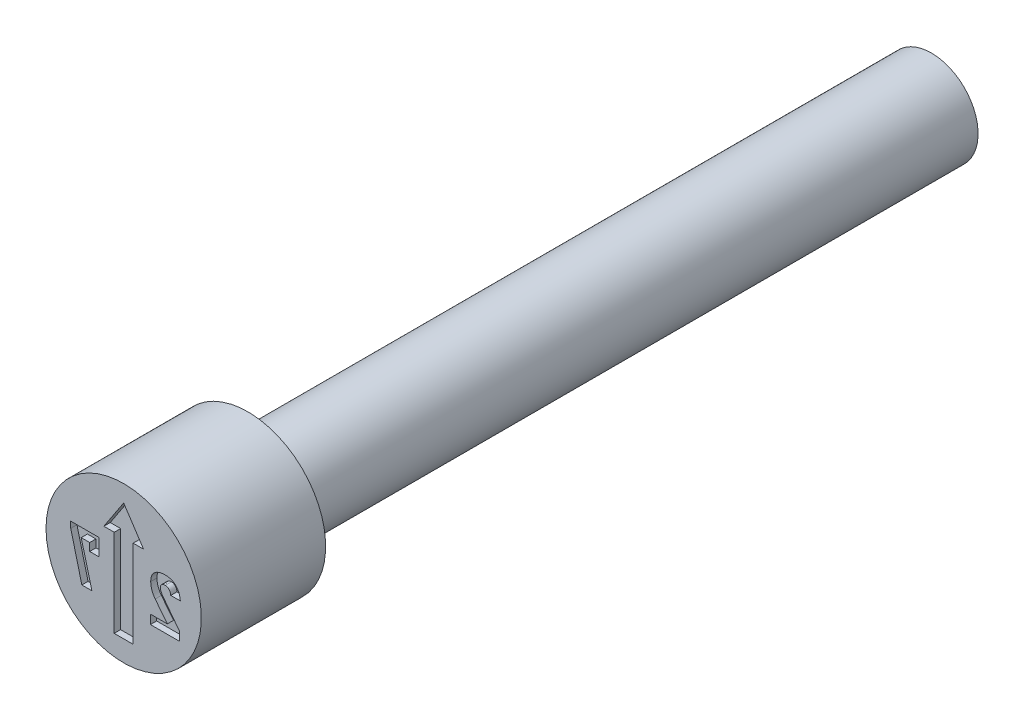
ISO-10303-21;
HEADER;
FILE_DESCRIPTION(('STEP AP214'),'2;1');
FILE_NAME('part.step','',(''),(''),'','','');
FILE_SCHEMA(('AUTOMOTIVE_DESIGN { 1 0 10303 214 1 1 1 1 }'));
ENDSEC;
DATA;
#1=APPLICATION_CONTEXT('core data for automotive mechanical design processes');
#2=APPLICATION_PROTOCOL_DEFINITION('international standard','automotive_design',2000,#1);
#3=PRODUCT_CONTEXT('',#1,'mechanical');
#4=PRODUCT('Part','Part','',(#3));
#5=PRODUCT_RELATED_PRODUCT_CATEGORY('part','',(#4));
#6=PRODUCT_DEFINITION_FORMATION('','',#4);
#7=PRODUCT_DEFINITION_CONTEXT('part definition',#1,'design');
#8=PRODUCT_DEFINITION('design','',#6,#7);
#9=PRODUCT_DEFINITION_SHAPE('','',#8);
#10=(LENGTH_UNIT() NAMED_UNIT(*) SI_UNIT(.MILLI.,.METRE.));
#11=(NAMED_UNIT(*) PLANE_ANGLE_UNIT() SI_UNIT($,.RADIAN.));
#12=(NAMED_UNIT(*) SI_UNIT($,.STERADIAN.) SOLID_ANGLE_UNIT());
#13=UNCERTAINTY_MEASURE_WITH_UNIT(LENGTH_MEASURE(1.E-05),#10,'distance_accuracy_value','');
#14=(GEOMETRIC_REPRESENTATION_CONTEXT(3) GLOBAL_UNCERTAINTY_ASSIGNED_CONTEXT((#13)) GLOBAL_UNIT_ASSIGNED_CONTEXT((#10,
#11,#12)) REPRESENTATION_CONTEXT('',''));
#15=CARTESIAN_POINT('',(0.,0.,0.));
#16=DIRECTION('',(0.,0.,1.));
#17=DIRECTION('',(1.,0.,0.));
#18=AXIS2_PLACEMENT_3D('',#15,#16,#17);
#19=CARTESIAN_POINT('',(-0.1524,0.495314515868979,-1.6556487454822));
#20=DIRECTION('',(-1.,0.,0.));
#21=DIRECTION('',(0.,-1.,0.));
#22=AXIS2_PLACEMENT_3D('',#19,#20,#21);
#23=PLANE('',#22);
#24=DIRECTION('',(0.,-1.,0.));
#25=VECTOR('',#24,1.);
#26=CARTESIAN_POINT('',(-0.1524,0.495314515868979,-0.10335957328));
#27=LINE('',#26,#25);
#28=CARTESIAN_POINT('',(-0.1524,0.495314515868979,-0.10335957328));
#29=VERTEX_POINT('',#28);
#30=CARTESIAN_POINT('',(-0.1524,-0.9144,-0.10335957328));
#31=VERTEX_POINT('',#30);
#32=EDGE_CURVE('E439',#29,#31,#27,.T.);
#33=ORIENTED_EDGE('',*,*,#32,.F.);
#34=DIRECTION('',(0.,0.,1.));
#35=VECTOR('',#34,1.);
#36=CARTESIAN_POINT('',(-0.1524,0.495314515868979,-0.10667978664));
#37=LINE('',#36,#35);
#38=CARTESIAN_POINT('',(-0.1524,0.495314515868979,0.));
#39=VERTEX_POINT('',#38);
#40=EDGE_CURVE('E425',#39,#29,#37,.F.);
#41=ORIENTED_EDGE('',*,*,#40,.F.);
#42=DIRECTION('',(0.,1.,0.));
#43=VECTOR('',#42,1.);
#44=CARTESIAN_POINT('',(-0.1524,0.,0.));
#45=LINE('',#44,#43);
#46=CARTESIAN_POINT('',(-0.1524,-0.9144,0.));
#47=VERTEX_POINT('',#46);
#48=EDGE_CURVE('E468',#47,#39,#45,.T.);
#49=ORIENTED_EDGE('',*,*,#48,.F.);
#50=DIRECTION('',(0.,0.,-1.));
#51=VECTOR('',#50,1.);
#52=CARTESIAN_POINT('',(-0.1524,-0.9144,-1.6556487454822));
#53=LINE('',#52,#51);
#54=EDGE_CURVE('E470',#47,#31,#53,.T.);
#55=ORIENTED_EDGE('',*,*,#54,.T.);
#56=EDGE_LOOP('',(#33,#41,#49,#55));
#57=FACE_BOUND('',#56,.T.);
#58=ADVANCED_FACE('F37',(#57),#23,.F.);
#59=CARTESIAN_POINT('',(2.096096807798E-13,0.495314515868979,-0.10667978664));
#60=DIRECTION('',(0.,1.,0.));
#61=DIRECTION('',(0.,0.,1.));
#62=AXIS2_PLACEMENT_3D('',#59,#60,#61);
#63=PLANE('',#62);
#64=ORIENTED_EDGE('',*,*,#40,.T.);
#65=DIRECTION('',(1.,0.,0.));
#66=VECTOR('',#65,1.);
#67=CARTESIAN_POINT('',(-0.31923088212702,0.495314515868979,-0.10335957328));
#68=LINE('',#67,#66);
#69=CARTESIAN_POINT('',(-0.319230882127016,0.495314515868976,-0.10335957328));
#70=VERTEX_POINT('',#69);
#71=EDGE_CURVE('E427',#70,#29,#68,.T.);
#72=ORIENTED_EDGE('',*,*,#71,.F.);
#73=DIRECTION('',(0.,0.,1.));
#74=VECTOR('',#73,1.);
#75=CARTESIAN_POINT('',(-0.319230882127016,0.495314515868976,-0.48767902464));
#76=LINE('',#75,#74);
#77=CARTESIAN_POINT('',(-0.31923088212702,0.495314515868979,0.));
#78=VERTEX_POINT('',#77);
#79=EDGE_CURVE('E432',#70,#78,#76,.T.);
#80=ORIENTED_EDGE('',*,*,#79,.T.);
#81=DIRECTION('',(1.,0.,0.));
#82=VECTOR('',#81,1.);
#83=CARTESIAN_POINT('',(0.62499875,0.495314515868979,0.));
#84=LINE('',#83,#82);
#85=EDGE_CURVE('E430',#39,#78,#84,.F.);
#86=ORIENTED_EDGE('',*,*,#85,.F.);
#87=EDGE_LOOP('',(#64,#72,#80,#86));
#88=FACE_BOUND('',#87,.T.);
#89=ADVANCED_FACE('F415',(#88),#63,.T.);
#90=CARTESIAN_POINT('',(-0.54143825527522,0.158036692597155,-0.48767902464));
#91=DIRECTION('',(-0.835059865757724,0.550159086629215,0.));
#92=DIRECTION('',(-0.550159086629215,-0.835059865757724,0.));
#93=AXIS2_PLACEMENT_3D('',#90,#91,#92);
#94=PLANE('',#93);
#95=DIRECTION('',(-0.550159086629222,-0.835059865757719,0.));
#96=VECTOR('',#95,1.);
#97=CARTESIAN_POINT('',(0.,0.979859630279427,-0.10335957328));
#98=LINE('',#97,#96);
#99=CARTESIAN_POINT('',(0.,0.979859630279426,-0.10335957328));
#100=VERTEX_POINT('',#99);
#101=EDGE_CURVE('E441',#100,#70,#98,.T.);
#102=ORIENTED_EDGE('',*,*,#101,.F.);
#103=DIRECTION('',(0.,0.,1.));
#104=VECTOR('',#103,1.);
#105=CARTESIAN_POINT('',(0.,0.979859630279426,-0.48767902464));
#106=LINE('',#105,#104);
#107=CARTESIAN_POINT('',(0.,0.979859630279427,0.));
#108=VERTEX_POINT('',#107);
#109=EDGE_CURVE('E480',#100,#108,#106,.T.);
#110=ORIENTED_EDGE('',*,*,#109,.T.);
#111=DIRECTION('',(0.550159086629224,0.835059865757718,0.));
#112=VECTOR('',#111,1.);
#113=CARTESIAN_POINT('',(-0.319230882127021,0.495314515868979,0.));
#114=LINE('',#113,#112);
#115=EDGE_CURVE('E464',#78,#108,#114,.T.);
#116=ORIENTED_EDGE('',*,*,#115,.F.);
#117=ORIENTED_EDGE('',*,*,#79,.F.);
#118=EDGE_LOOP('',(#102,#110,#116,#117));
#119=FACE_BOUND('',#118,.T.);
#120=ADVANCED_FACE('F412',(#119),#94,.F.);
#121=CARTESIAN_POINT('',(0.,0.979859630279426,-0.48767902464));
#122=DIRECTION('',(0.835059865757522,0.550159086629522,0.));
#123=DIRECTION('',(-0.550159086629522,0.835059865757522,0.));
#124=AXIS2_PLACEMENT_3D('',#121,#122,#123);
#125=PLANE('',#124);
#126=DIRECTION('',(-0.550159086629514,0.835059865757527,0.));
#127=VECTOR('',#126,1.);
#128=CARTESIAN_POINT('',(0.319230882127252,0.495314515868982,-0.10335957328));
#129=LINE('',#128,#127);
#130=CARTESIAN_POINT('',(0.319230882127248,0.495314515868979,-0.10335957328));
#131=VERTEX_POINT('',#130);
#132=EDGE_CURVE('E445',#131,#100,#129,.T.);
#133=ORIENTED_EDGE('',*,*,#132,.F.);
#134=DIRECTION('',(0.,0.,1.));
#135=VECTOR('',#134,1.);
#136=CARTESIAN_POINT('',(0.319230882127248,0.495314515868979,-0.10667978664));
#137=LINE('',#136,#135);
#138=CARTESIAN_POINT('',(0.319230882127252,0.495314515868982,0.));
#139=VERTEX_POINT('',#138);
#140=EDGE_CURVE('E477',#139,#131,#137,.F.);
#141=ORIENTED_EDGE('',*,*,#140,.F.);
#142=DIRECTION('',(0.550159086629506,-0.835059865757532,0.));
#143=VECTOR('',#142,1.);
#144=CARTESIAN_POINT('',(0.,0.979859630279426,0.));
#145=LINE('',#144,#143);
#146=EDGE_CURVE('E461',#108,#139,#145,.T.);
#147=ORIENTED_EDGE('',*,*,#146,.F.);
#148=ORIENTED_EDGE('',*,*,#109,.F.);
#149=EDGE_LOOP('',(#133,#141,#147,#148));
#150=FACE_BOUND('',#149,.T.);
#151=ADVANCED_FACE('F408',(#150),#125,.F.);
#152=CARTESIAN_POINT('',(2.096096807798E-13,0.495314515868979,-0.10667978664));
#153=DIRECTION('',(0.,1.,0.));
#154=DIRECTION('',(0.,0.,1.));
#155=AXIS2_PLACEMENT_3D('',#152,#153,#154);
#156=PLANE('',#155);
#157=ORIENTED_EDGE('',*,*,#140,.T.);
#158=DIRECTION('',(1.,0.,0.));
#159=VECTOR('',#158,1.);
#160=CARTESIAN_POINT('',(0.1524,0.495314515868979,-0.10335957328));
#161=LINE('',#160,#159);
#162=CARTESIAN_POINT('',(0.1524,0.495314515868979,-0.10335957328));
#163=VERTEX_POINT('',#162);
#164=EDGE_CURVE('E502',#163,#131,#161,.T.);
#165=ORIENTED_EDGE('',*,*,#164,.F.);
#166=DIRECTION('',(0.,0.,1.));
#167=VECTOR('',#166,1.);
#168=CARTESIAN_POINT('',(0.1524,0.495314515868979,-1.6556487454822));
#169=LINE('',#168,#167);
#170=CARTESIAN_POINT('',(0.1524,0.495314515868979,0.));
#171=VERTEX_POINT('',#170);
#172=EDGE_CURVE('E475',#163,#171,#169,.T.);
#173=ORIENTED_EDGE('',*,*,#172,.T.);
#174=DIRECTION('',(1.,0.,0.));
#175=VECTOR('',#174,1.);
#176=CARTESIAN_POINT('',(0.62499875,0.495314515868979,0.));
#177=LINE('',#176,#175);
#178=EDGE_CURVE('E458',#139,#171,#177,.F.);
#179=ORIENTED_EDGE('',*,*,#178,.F.);
#180=EDGE_LOOP('',(#157,#165,#173,#179));
#181=FACE_BOUND('',#180,.T.);
#182=ADVANCED_FACE('F404',(#181),#156,.T.);
#183=CARTESIAN_POINT('',(0.1524,0.495314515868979,-1.6556487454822));
#184=DIRECTION('',(1.,0.,0.));
#185=DIRECTION('',(0.,1.,0.));
#186=AXIS2_PLACEMENT_3D('',#183,#184,#185);
#187=PLANE('',#186);
#188=DIRECTION('',(0.,1.,0.));
#189=VECTOR('',#188,1.);
#190=CARTESIAN_POINT('',(0.1524,-0.9144,-0.10335957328));
#191=LINE('',#190,#189);
#192=CARTESIAN_POINT('',(0.1524,-0.9144,-0.10335957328));
#193=VERTEX_POINT('',#192);
#194=EDGE_CURVE('E433',#193,#163,#191,.T.);
#195=ORIENTED_EDGE('',*,*,#194,.F.);
#196=DIRECTION('',(0.,0.,-1.));
#197=VECTOR('',#196,1.);
#198=CARTESIAN_POINT('',(0.1524,-0.9144,-1.6556487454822));
#199=LINE('',#198,#197);
#200=CARTESIAN_POINT('',(0.1524,-0.9144,0.));
#201=VERTEX_POINT('',#200);
#202=EDGE_CURVE('E473',#193,#201,#199,.F.);
#203=ORIENTED_EDGE('',*,*,#202,.T.);
#204=DIRECTION('',(0.,1.,0.));
#205=VECTOR('',#204,1.);
#206=CARTESIAN_POINT('',(0.1524,0.,0.));
#207=LINE('',#206,#205);
#208=EDGE_CURVE('E455',#171,#201,#207,.F.);
#209=ORIENTED_EDGE('',*,*,#208,.F.);
#210=ORIENTED_EDGE('',*,*,#172,.F.);
#211=EDGE_LOOP('',(#195,#203,#209,#210));
#212=FACE_BOUND('',#211,.T.);
#213=ADVANCED_FACE('F400',(#212),#187,.F.);
#214=CARTESIAN_POINT('',(-0.1524,-0.9144,-1.6556487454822));
#215=DIRECTION('',(0.,-1.,0.));
#216=DIRECTION('',(0.,0.,-1.));
#217=AXIS2_PLACEMENT_3D('',#214,#215,#216);
#218=PLANE('',#217);
#219=DIRECTION('',(1.,0.,0.));
#220=VECTOR('',#219,1.);
#221=CARTESIAN_POINT('',(-0.1524,-0.9144,-0.10335957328));
#222=LINE('',#221,#220);
#223=EDGE_CURVE('E443',#31,#193,#222,.T.);
#224=ORIENTED_EDGE('',*,*,#223,.F.);
#225=ORIENTED_EDGE('',*,*,#54,.F.);
#226=DIRECTION('',(1.,0.,0.));
#227=VECTOR('',#226,1.);
#228=CARTESIAN_POINT('',(0.62499875,-0.9144,0.));
#229=LINE('',#228,#227);
#230=EDGE_CURVE('E452',#201,#47,#229,.F.);
#231=ORIENTED_EDGE('',*,*,#230,.F.);
#232=ORIENTED_EDGE('',*,*,#202,.F.);
#233=EDGE_LOOP('',(#224,#225,#231,#232));
#234=FACE_BOUND('',#233,.T.);
#235=ADVANCED_FACE('F383',(#234),#218,.F.);
#236=CARTESIAN_POINT('',(0.62499875,0.,0.));
#237=DIRECTION('',(0.,0.,1.));
#238=DIRECTION('',(1.,0.,0.));
#239=AXIS2_PLACEMENT_3D('',#236,#237,#238);
#240=PLANE('',#239);
#241=DIRECTION('',(-1.,0.,0.));
#242=VECTOR('',#241,1.);
#243=CARTESIAN_POINT('',(-0.396543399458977,0.3,0.));
#244=LINE('',#243,#242);
#245=CARTESIAN_POINT('',(-0.396543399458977,0.3,0.));
#246=VERTEX_POINT('',#245);
#247=CARTESIAN_POINT('',(-0.851738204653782,0.3,0.));
#248=VERTEX_POINT('',#247);
#249=EDGE_CURVE('E53',#246,#248,#244,.T.);
#250=ORIENTED_EDGE('',*,*,#249,.F.);
#251=DIRECTION('',(0.,1.,0.));
#252=VECTOR('',#251,1.);
#253=CARTESIAN_POINT('',(-0.396543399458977,0.0298701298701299,0.));
#254=LINE('',#253,#252);
#255=CARTESIAN_POINT('',(-0.396543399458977,0.0298701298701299,0.));
#256=VERTEX_POINT('',#255);
#257=EDGE_CURVE('E274',#256,#246,#254,.T.);
#258=ORIENTED_EDGE('',*,*,#257,.F.);
#259=DIRECTION('',(1.,0.,0.));
#260=VECTOR('',#259,1.);
#261=CARTESIAN_POINT('',(-0.546705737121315,0.0298701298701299,0.));
#262=LINE('',#261,#260);
#263=CARTESIAN_POINT('',(-0.546705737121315,0.0298701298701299,0.));
#264=VERTEX_POINT('',#263);
#265=EDGE_CURVE('E277',#264,#256,#262,.T.);
#266=ORIENTED_EDGE('',*,*,#265,.F.);
#267=DIRECTION('',(0.,-1.,0.));
#268=VECTOR('',#267,1.);
#269=CARTESIAN_POINT('',(-0.546705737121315,0.154545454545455,0.));
#270=LINE('',#269,#268);
#271=CARTESIAN_POINT('',(-0.546705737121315,0.154545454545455,0.));
#272=VERTEX_POINT('',#271);
#273=EDGE_CURVE('E311',#272,#264,#270,.T.);
#274=ORIENTED_EDGE('',*,*,#273,.F.);
#275=DIRECTION('',(1.,0.,0.));
#276=VECTOR('',#275,1.);
#277=CARTESIAN_POINT('',(-0.683556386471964,0.154545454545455,0.));
#278=LINE('',#277,#276);
#279=CARTESIAN_POINT('',(-0.683556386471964,0.154545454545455,0.));
#280=VERTEX_POINT('',#279);
#281=EDGE_CURVE('E308',#280,#272,#278,.T.);
#282=ORIENTED_EDGE('',*,*,#281,.F.);
#283=DIRECTION('',(-0.255602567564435,0.966781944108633,0.));
#284=VECTOR('',#283,1.);
#285=CARTESIAN_POINT('',(-0.510504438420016,-0.5,0.));
#286=LINE('',#285,#284);
#287=CARTESIAN_POINT('',(-0.510504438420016,-0.5,0.));
#288=VERTEX_POINT('',#287);
#289=EDGE_CURVE('E305',#288,#280,#286,.T.);
#290=ORIENTED_EDGE('',*,*,#289,.F.);
#291=DIRECTION('',(1.,0.,0.));
#292=VECTOR('',#291,1.);
#293=CARTESIAN_POINT('',(-0.673166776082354,-0.5,0.));
#294=LINE('',#293,#292);
#295=CARTESIAN_POINT('',(-0.673166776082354,-0.5,0.));
#296=VERTEX_POINT('',#295);
#297=EDGE_CURVE('E302',#296,#288,#294,.T.);
#298=ORIENTED_EDGE('',*,*,#297,.F.);
#299=DIRECTION('',(0.247293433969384,-0.968940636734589,0.));
#300=VECTOR('',#299,1.);
#301=CARTESIAN_POINT('',(-0.851738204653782,0.199675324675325,0.));
#302=LINE('',#301,#300);
#303=CARTESIAN_POINT('',(-0.851738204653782,0.199675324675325,0.));
#304=VERTEX_POINT('',#303);
#305=EDGE_CURVE('E299',#304,#296,#302,.T.);
#306=ORIENTED_EDGE('',*,*,#305,.F.);
#307=DIRECTION('',(0.,-1.,0.));
#308=VECTOR('',#307,1.);
#309=CARTESIAN_POINT('',(-0.851738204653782,0.3,0.));
#310=LINE('',#309,#308);
#311=EDGE_CURVE('E297',#248,#304,#310,.T.);
#312=ORIENTED_EDGE('',*,*,#311,.F.);
#313=EDGE_LOOP('',(#250,#258,#266,#274,#282,#290,#298,#306,#312));
#314=FACE_BOUND('',#313,.T.);
#315=DIRECTION('',(1.,0.,0.));
#316=VECTOR('',#315,1.);
#317=CARTESIAN_POINT('',(0.43070984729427,-0.5,0.));
#318=LINE('',#317,#316);
#319=CARTESIAN_POINT('',(0.43070984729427,-0.5,0.));
#320=VERTEX_POINT('',#319);
#321=CARTESIAN_POINT('',(0.901813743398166,-0.5,0.));
#322=VERTEX_POINT('',#321);
#323=EDGE_CURVE('E61',#320,#322,#318,.T.);
#324=ORIENTED_EDGE('',*,*,#323,.F.);
#325=DIRECTION('',(0.,-1.,0.));
#326=VECTOR('',#325,1.);
#327=CARTESIAN_POINT('',(0.43070984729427,-0.354545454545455,0.));
#328=LINE('',#327,#326);
#329=CARTESIAN_POINT('',(0.43070984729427,-0.354545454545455,0.));
#330=VERTEX_POINT('',#329);
#331=EDGE_CURVE('E335',#330,#320,#328,.T.);
#332=ORIENTED_EDGE('',*,*,#331,.F.);
#333=DIRECTION('',(-1.,0.,0.));
#334=VECTOR('',#333,1.);
#335=CARTESIAN_POINT('',(0.70295010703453,-0.354545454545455,0.));
#336=LINE('',#335,#334);
#337=CARTESIAN_POINT('',(0.70295010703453,-0.354545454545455,0.));
#338=VERTEX_POINT('',#337);
#339=EDGE_CURVE('E542',#338,#330,#336,.T.);
#340=ORIENTED_EDGE('',*,*,#339,.F.);
#341=DIRECTION('',(0.618183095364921,-0.786034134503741,0.));
#342=VECTOR('',#341,1.);
#343=CARTESIAN_POINT('',(0.506846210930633,-0.105194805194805,0.));
#344=LINE('',#343,#342);
#345=CARTESIAN_POINT('',(0.506846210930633,-0.105194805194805,0.));
#346=VERTEX_POINT('',#345);
#347=EDGE_CURVE('E545',#346,#338,#344,.T.);
#348=ORIENTED_EDGE('',*,*,#347,.F.);
#349=CARTESIAN_POINT('',(0.435092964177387,0.100649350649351,0.));
#350=CARTESIAN_POINT('',(0.43529993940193,0.0915468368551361,0.));
#351=CARTESIAN_POINT('',(0.435714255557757,0.0733257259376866,0.));
#352=CARTESIAN_POINT('',(0.439454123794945,0.0460552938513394,0.));
#353=CARTESIAN_POINT('',(0.445480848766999,0.0189240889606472,0.));
#354=CARTESIAN_POINT('',(0.453757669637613,-0.00793681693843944,0.));
#355=CARTESIAN_POINT('',(0.464039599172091,-0.0340621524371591,0.));
#356=CARTESIAN_POINT('',(0.476379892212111,-0.0590941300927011,0.));
#357=CARTESIAN_POINT('',(0.490307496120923,-0.0830438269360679,0.));
#358=CARTESIAN_POINT('',(0.501343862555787,-0.0978252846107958,0.));
#359=CARTESIAN_POINT('',(0.506846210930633,-0.105194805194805,0.));
#360=B_SPLINE_CURVE_WITH_KNOTS('',3,(#349,#350,#351,#352,#353,#354,#355,#356,#357,#358,#359),
.UNSPECIFIED.,.F.,.F.,(4,1,1,1,1,1,1,1,4),(0.,0.123046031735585,0.246309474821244,
0.371480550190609,0.498560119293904,0.626024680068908,0.750715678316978,0.875715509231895,1.),.UNSPECIFIED.);
#361=CARTESIAN_POINT('',(0.435092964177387,0.100649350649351,0.));
#362=VERTEX_POINT('',#361);
#363=EDGE_CURVE('E548',#362,#346,#360,.T.);
#364=ORIENTED_EDGE('',*,*,#363,.F.);
#365=DIRECTION('',(0.,-1.,0.));
#366=VECTOR('',#365,1.);
#367=CARTESIAN_POINT('',(0.435092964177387,0.101298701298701,0.));
#368=LINE('',#367,#366);
#369=CARTESIAN_POINT('',(0.435092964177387,0.101298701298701,0.));
#370=VERTEX_POINT('',#369);
#371=EDGE_CURVE('E553',#370,#362,#368,.T.);
#372=ORIENTED_EDGE('',*,*,#371,.F.);
#373=CARTESIAN_POINT('',(0.670644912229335,0.31038961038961,0.));
#374=CARTESIAN_POINT('',(0.661546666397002,0.310260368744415,0.));
#375=CARTESIAN_POINT('',(0.643851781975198,0.310009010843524,0.));
#376=CARTESIAN_POINT('',(0.618091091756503,0.307295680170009,0.));
#377=CARTESIAN_POINT('',(0.593853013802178,0.303200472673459,0.));
#378=CARTESIAN_POINT('',(0.571176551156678,0.297209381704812,0.));
#379=CARTESIAN_POINT('',(0.550152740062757,0.289394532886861,0.));
#380=CARTESIAN_POINT('',(0.530718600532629,0.27997174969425,0.));
#381=CARTESIAN_POINT('',(0.512833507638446,0.268860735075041,0.));
#382=CARTESIAN_POINT('',(0.496634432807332,0.256037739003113,0.));
#383=CARTESIAN_POINT('',(0.482059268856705,0.241735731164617,0.));
#384=CARTESIAN_POINT('',(0.469513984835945,0.225809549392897,0.));
#385=CARTESIAN_POINT('',(0.458653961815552,0.208581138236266,0.));
#386=CARTESIAN_POINT('',(0.450164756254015,0.189716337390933,0.));
#387=CARTESIAN_POINT('',(0.44317575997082,0.169658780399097,0.));
#388=CARTESIAN_POINT('',(0.438650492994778,0.148048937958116,0.));
#389=CARTESIAN_POINT('',(0.435601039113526,0.125141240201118,0.));
#390=CARTESIAN_POINT('',(0.43526500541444,0.109372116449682,0.));
#391=CARTESIAN_POINT('',(0.435092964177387,0.101298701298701,0.));
#392=B_SPLINE_CURVE_WITH_KNOTS('',3,(#373,#374,#375,#376,#377,#378,#379,#380,#381,#382,#383,
#384,#385,#386,#387,#388,#389,#390,#391),.UNSPECIFIED.,.F.,.F.,(4,1,1,1,1,1,1,1,1,1,1,1,1,1,1,1,
4),(0.,0.0762312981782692,0.148259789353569,0.216860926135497,0.282100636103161,
0.344528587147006,0.404571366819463,0.462840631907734,0.520642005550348,0.577409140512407,
0.633580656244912,0.690215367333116,0.747647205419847,0.806597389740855,0.867894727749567,
0.932365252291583,1.),.UNSPECIFIED.);
#393=CARTESIAN_POINT('',(0.670644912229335,0.31038961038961,0.));
#394=VERTEX_POINT('',#393);
#395=EDGE_CURVE('E559',#394,#370,#392,.T.);
#396=ORIENTED_EDGE('',*,*,#395,.F.);
#397=CARTESIAN_POINT('',(0.911716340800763,0.0702922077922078,0.));
#398=CARTESIAN_POINT('',(0.910956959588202,0.0795653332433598,0.));
#399=CARTESIAN_POINT('',(0.909474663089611,0.0976662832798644,0.));
#400=CARTESIAN_POINT('',(0.904615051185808,0.123850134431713,0.));
#401=CARTESIAN_POINT('',(0.898334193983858,0.14851353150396,0.));
#402=CARTESIAN_POINT('',(0.890344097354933,0.171651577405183,0.));
#403=CARTESIAN_POINT('',(0.880076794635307,0.192996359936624,0.));
#404=CARTESIAN_POINT('',(0.868541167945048,0.2129940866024,0.));
#405=CARTESIAN_POINT('',(0.854666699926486,0.231026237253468,0.));
#406=CARTESIAN_POINT('',(0.839479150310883,0.247696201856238,0.));
#407=CARTESIAN_POINT('',(0.822562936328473,0.26237886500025,0.));
#408=CARTESIAN_POINT('',(0.804525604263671,0.27533094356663,0.));
#409=CARTESIAN_POINT('',(0.78509440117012,0.286109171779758,0.));
#410=CARTESIAN_POINT('',(0.764564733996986,0.295050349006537,0.));
#411=CARTESIAN_POINT('',(0.742708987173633,0.301836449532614,0.));
#412=CARTESIAN_POINT('',(0.719812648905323,0.306919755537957,0.));
#413=CARTESIAN_POINT('',(0.695612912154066,0.309851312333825,0.));
#414=CARTESIAN_POINT('',(0.679094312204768,0.310207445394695,0.));
#415=CARTESIAN_POINT('',(0.670644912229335,0.31038961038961,0.));
#416=B_SPLINE_CURVE_WITH_KNOTS('',3,(#397,#398,#399,#400,#401,#402,#403,#404,#405,#406,#407,
#408,#409,#410,#411,#412,#413,#414,#415),.UNSPECIFIED.,.F.,.F.,(4,1,1,1,1,1,1,1,1,1,1,1,1,1,1,1,
4),(0.,0.073326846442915,0.14313249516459,0.209679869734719,0.273918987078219,0.335762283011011,
0.396210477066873,0.45560885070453,0.514796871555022,0.573764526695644,0.631900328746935,
0.689592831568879,0.748648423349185,0.808163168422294,0.86976604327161,0.933384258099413,1.),.UNSPECIFIED.);
#417=CARTESIAN_POINT('',(0.911716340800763,0.0702922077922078,0.));
#418=VERTEX_POINT('',#417);
#419=EDGE_CURVE('E564',#418,#394,#416,.T.);
#420=ORIENTED_EDGE('',*,*,#419,.F.);
#421=DIRECTION('',(0.,1.,0.));
#422=VECTOR('',#421,1.);
#423=CARTESIAN_POINT('',(0.911716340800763,0.0698051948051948,0.));
#424=LINE('',#423,#422);
#425=CARTESIAN_POINT('',(0.911716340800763,0.0698051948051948,0.));
#426=VERTEX_POINT('',#425);
#427=EDGE_CURVE('E572',#426,#418,#424,.T.);
#428=ORIENTED_EDGE('',*,*,#427,.F.);
#429=DIRECTION('',(1.,0.,0.));
#430=VECTOR('',#429,1.);
#431=CARTESIAN_POINT('',(0.757820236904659,0.0698051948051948,0.));
#432=LINE('',#431,#430);
#433=CARTESIAN_POINT('',(0.757820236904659,0.0698051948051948,0.));
#434=VERTEX_POINT('',#433);
#435=EDGE_CURVE('E578',#434,#426,#432,.T.);
#436=ORIENTED_EDGE('',*,*,#435,.F.);
#437=DIRECTION('',(0.,-1.,0.));
#438=VECTOR('',#437,1.);
#439=CARTESIAN_POINT('',(0.757820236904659,0.0702922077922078,0.));
#440=LINE('',#439,#438);
#441=CARTESIAN_POINT('',(0.75782023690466,0.0702922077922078,0.));
#442=VERTEX_POINT('',#441);
#443=EDGE_CURVE('E581',#442,#434,#440,.T.);
#444=ORIENTED_EDGE('',*,*,#443,.F.);
#445=CARTESIAN_POINT('',(0.669508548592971,0.164935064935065,0.));
#446=CARTESIAN_POINT('',(0.675389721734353,0.164705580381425,0.));
#447=CARTESIAN_POINT('',(0.686817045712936,0.164259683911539,0.));
#448=CARTESIAN_POINT('',(0.702994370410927,0.159317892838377,0.));
#449=CARTESIAN_POINT('',(0.717571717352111,0.151566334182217,0.));
#450=CARTESIAN_POINT('',(0.730138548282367,0.140505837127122,0.));
#451=CARTESIAN_POINT('',(0.740544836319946,0.126618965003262,0.));
#452=CARTESIAN_POINT('',(0.748990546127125,0.110266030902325,0.));
#453=CARTESIAN_POINT('',(0.75472680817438,0.0911517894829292,0.));
#454=CARTESIAN_POINT('',(0.756755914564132,0.0774691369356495,0.));
#455=CARTESIAN_POINT('',(0.75782023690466,0.0702922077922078,0.));
#456=B_SPLINE_CURVE_WITH_KNOTS('',3,(#445,#446,#447,#448,#449,#450,#451,#452,#453,#454,#455),
.UNSPECIFIED.,.F.,.F.,(4,1,1,1,1,1,1,1,4),(0.,0.122603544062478,0.238222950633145,
0.350089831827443,0.465559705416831,0.58502806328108,0.711014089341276,0.848418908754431,1.),.UNSPECIFIED.);
#457=CARTESIAN_POINT('',(0.669508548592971,0.164935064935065,0.));
#458=VERTEX_POINT('',#457);
#459=EDGE_CURVE('E584',#458,#442,#456,.T.);
#460=ORIENTED_EDGE('',*,*,#459,.F.);
#461=CARTESIAN_POINT('',(0.589638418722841,0.0970779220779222,0.));
#462=CARTESIAN_POINT('',(0.589860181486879,0.102193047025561,0.));
#463=CARTESIAN_POINT('',(0.590285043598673,0.11199281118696,0.));
#464=CARTESIAN_POINT('',(0.59428791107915,0.125800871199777,0.));
#465=CARTESIAN_POINT('',(0.600848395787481,0.137825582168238,0.));
#466=CARTESIAN_POINT('',(0.610244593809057,0.147757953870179,0.));
#467=CARTESIAN_POINT('',(0.621942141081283,0.155613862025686,0.));
#468=CARTESIAN_POINT('',(0.635938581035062,0.161150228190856,0.));
#469=CARTESIAN_POINT('',(0.652050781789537,0.164324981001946,0.));
#470=CARTESIAN_POINT('',(0.663487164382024,0.164724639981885,0.));
#471=CARTESIAN_POINT('',(0.669508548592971,0.164935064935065,0.));
#472=B_SPLINE_CURVE_WITH_KNOTS('',3,(#461,#462,#463,#464,#465,#466,#467,#468,#469,#470,#471),
.UNSPECIFIED.,.F.,.F.,(4,1,1,1,1,1,1,1,4),(0.,0.128749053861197,0.246662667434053,
0.359069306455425,0.47107757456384,0.588039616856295,0.711712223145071,0.848213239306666,1.),.UNSPECIFIED.);
#473=CARTESIAN_POINT('',(0.589638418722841,0.0970779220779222,0.));
#474=VERTEX_POINT('',#473);
#475=EDGE_CURVE('E589',#474,#458,#472,.T.);
#476=ORIENTED_EDGE('',*,*,#475,.F.);
#477=DIRECTION('',(0.,1.,0.));
#478=VECTOR('',#477,1.);
#479=CARTESIAN_POINT('',(0.589638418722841,0.0959415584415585,0.));
#480=LINE('',#479,#478);
#481=CARTESIAN_POINT('',(0.589638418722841,0.0959415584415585,0.));
#482=VERTEX_POINT('',#481);
#483=EDGE_CURVE('E597',#482,#474,#480,.T.);
#484=ORIENTED_EDGE('',*,*,#483,.F.);
#485=CARTESIAN_POINT('',(0.628437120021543,-0.00178571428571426,0.));
#486=CARTESIAN_POINT('',(0.622711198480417,0.00628241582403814,0.));
#487=CARTESIAN_POINT('',(0.611554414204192,0.0220029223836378,0.));
#488=CARTESIAN_POINT('',(0.601456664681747,0.0435918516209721,0.));
#489=CARTESIAN_POINT('',(0.595166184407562,0.060517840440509,0.));
#490=CARTESIAN_POINT('',(0.592168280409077,0.0727925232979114,0.));
#491=CARTESIAN_POINT('',(0.590029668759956,0.0845037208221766,0.));
#492=CARTESIAN_POINT('',(0.58976644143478,0.0921989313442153,0.));
#493=CARTESIAN_POINT('',(0.589638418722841,0.0959415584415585,0.));
#494=B_SPLINE_CURVE_WITH_KNOTS('',3,(#485,#486,#487,#488,#489,#490,#491,#492,#493),
.UNSPECIFIED.,.F.,.F.,(4,1,1,1,1,1,4),(0.,0.277375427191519,0.540457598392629,0.666416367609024,
0.784009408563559,0.894951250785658,1.),.UNSPECIFIED.);
#495=CARTESIAN_POINT('',(0.628437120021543,-0.00178571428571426,0.));
#496=VERTEX_POINT('',#495);
#497=EDGE_CURVE('E603',#496,#482,#494,.T.);
#498=ORIENTED_EDGE('',*,*,#497,.F.);
#499=DIRECTION('',(-0.602458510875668,0.798150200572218,0.));
#500=VECTOR('',#499,1.);
#501=CARTESIAN_POINT('',(0.901813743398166,-0.363961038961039,0.));
#502=LINE('',#501,#500);
#503=CARTESIAN_POINT('',(0.901813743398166,-0.363961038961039,0.));
#504=VERTEX_POINT('',#503);
#505=EDGE_CURVE('E608',#504,#496,#502,.T.);
#506=ORIENTED_EDGE('',*,*,#505,.F.);
#507=DIRECTION('',(0.,1.,0.));
#508=VECTOR('',#507,1.);
#509=CARTESIAN_POINT('',(0.901813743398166,-0.5,0.));
#510=LINE('',#509,#508);
#511=EDGE_CURVE('E614',#322,#504,#510,.T.);
#512=ORIENTED_EDGE('',*,*,#511,.F.);
#513=EDGE_LOOP('',(#324,#332,#340,#348,#364,#372,#396,#420,#428,#436,#444,#460,#476,#484,#498,
#506,#512));
#514=FACE_BOUND('',#513,.T.);
#515=CARTESIAN_POINT('',(0.,0.,0.));
#516=DIRECTION('',(0.,0.,-1.));
#517=DIRECTION('',(-1.,0.,0.));
#518=AXIS2_PLACEMENT_3D('',#515,#516,#517);
#519=CIRCLE('',#518,1.2499975);
#520=CARTESIAN_POINT('',(-1.2499975,0.,0.));
#521=VERTEX_POINT('',#520);
#522=EDGE_CURVE('E40',#521,#521,#519,.T.);
#523=ORIENTED_EDGE('',*,*,#522,.F.);
#524=EDGE_LOOP('',(#523));
#525=FACE_BOUND('',#524,.T.);
#526=ORIENTED_EDGE('',*,*,#208,.T.);
#527=ORIENTED_EDGE('',*,*,#230,.T.);
#528=ORIENTED_EDGE('',*,*,#48,.T.);
#529=ORIENTED_EDGE('',*,*,#85,.T.);
#530=ORIENTED_EDGE('',*,*,#115,.T.);
#531=ORIENTED_EDGE('',*,*,#146,.T.);
#532=ORIENTED_EDGE('',*,*,#178,.T.);
#533=EDGE_LOOP('',(#526,#527,#528,#529,#530,#531,#532));
#534=FACE_BOUND('',#533,.T.);
#535=ADVANCED_FACE('F378',(#314,#514,#525,#534),#240,.T.);
#536=CARTESIAN_POINT('',(0.,0.,-0.999998));
#537=DIRECTION('',(0.,0.,-1.));
#538=DIRECTION('',(-1.,0.,0.));
#539=AXIS2_PLACEMENT_3D('',#536,#537,#538);
#540=CYLINDRICAL_SURFACE('',#539,1.2499975);
#541=ORIENTED_EDGE('',*,*,#522,.T.);
#542=EDGE_LOOP('',(#541));
#543=FACE_BOUND('',#542,.T.);
#544=CARTESIAN_POINT('',(0.,0.,-1.999996));
#545=DIRECTION('',(0.,0.,-1.));
#546=DIRECTION('',(-1.,0.,0.));
#547=AXIS2_PLACEMENT_3D('',#544,#545,#546);
#548=CIRCLE('',#547,1.2499975);
#549=CARTESIAN_POINT('',(-1.2499975,0.,-1.999996));
#550=VERTEX_POINT('',#549);
#551=EDGE_CURVE('E484',#550,#550,#548,.T.);
#552=ORIENTED_EDGE('',*,*,#551,.F.);
#553=EDGE_LOOP('',(#552));
#554=FACE_BOUND('',#553,.T.);
#555=ADVANCED_FACE('F390',(#543,#554),#540,.T.);
#556=CARTESIAN_POINT('',(0.999998,0.,-1.999996));
#557=DIRECTION('',(0.,0.,-1.));
#558=DIRECTION('',(-1.,0.,0.));
#559=AXIS2_PLACEMENT_3D('',#556,#557,#558);
#560=PLANE('',#559);
#561=CARTESIAN_POINT('',(0.,0.,-1.999996));
#562=DIRECTION('',(0.,0.,-1.));
#563=DIRECTION('',(-1.,0.,0.));
#564=AXIS2_PLACEMENT_3D('',#561,#562,#563);
#565=CIRCLE('',#564,0.7499985);
#566=CARTESIAN_POINT('',(-0.749998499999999,0.,-1.999996));
#567=VERTEX_POINT('',#566);
#568=EDGE_CURVE('E45',#567,#567,#565,.T.);
#569=ORIENTED_EDGE('',*,*,#568,.F.);
#570=EDGE_LOOP('',(#569));
#571=FACE_BOUND('',#570,.T.);
#572=ORIENTED_EDGE('',*,*,#551,.T.);
#573=EDGE_LOOP('',(#572));
#574=FACE_BOUND('',#573,.T.);
#575=ADVANCED_FACE('F386',(#571,#574),#560,.T.);
#576=CARTESIAN_POINT('',(0.37499925,0.,-12.999974));
#577=DIRECTION('',(0.,0.,-1.));
#578=DIRECTION('',(-1.,0.,0.));
#579=AXIS2_PLACEMENT_3D('',#576,#577,#578);
#580=PLANE('',#579);
#581=CARTESIAN_POINT('',(0.,0.,-12.999974));
#582=DIRECTION('',(0.,0.,-1.));
#583=DIRECTION('',(-1.,0.,0.));
#584=AXIS2_PLACEMENT_3D('',#581,#582,#583);
#585=CIRCLE('',#584,0.7499985);
#586=CARTESIAN_POINT('',(-0.749998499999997,0.,-12.999974));
#587=VERTEX_POINT('',#586);
#588=EDGE_CURVE('E11',#587,#587,#585,.F.);
#589=ORIENTED_EDGE('',*,*,#588,.F.);
#590=EDGE_LOOP('',(#589));
#591=FACE_BOUND('',#590,.T.);
#592=ADVANCED_FACE('F381',(#591),#580,.T.);
#593=CARTESIAN_POINT('',(0.,0.,-7.499985));
#594=DIRECTION('',(0.,0.,-1.));
#595=DIRECTION('',(-1.,0.,0.));
#596=AXIS2_PLACEMENT_3D('',#593,#594,#595);
#597=CYLINDRICAL_SURFACE('',#596,0.7499985);
#598=ORIENTED_EDGE('',*,*,#568,.T.);
#599=EDGE_LOOP('',(#598));
#600=FACE_BOUND('',#599,.T.);
#601=ORIENTED_EDGE('',*,*,#588,.T.);
#602=EDGE_LOOP('',(#601));
#603=FACE_BOUND('',#602,.T.);
#604=ADVANCED_FACE('F376',(#600,#603),#597,.T.);
#605=CARTESIAN_POINT('',(0.,0.,-0.10335957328));
#606=DIRECTION('',(0.,0.,-1.));
#607=DIRECTION('',(-1.,0.,0.));
#608=AXIS2_PLACEMENT_3D('',#605,#606,#607);
#609=PLANE('',#608);
#610=ORIENTED_EDGE('',*,*,#164,.T.);
#611=ORIENTED_EDGE('',*,*,#132,.T.);
#612=ORIENTED_EDGE('',*,*,#101,.T.);
#613=ORIENTED_EDGE('',*,*,#71,.T.);
#614=ORIENTED_EDGE('',*,*,#32,.T.);
#615=ORIENTED_EDGE('',*,*,#223,.T.);
#616=ORIENTED_EDGE('',*,*,#194,.T.);
#617=EDGE_LOOP('',(#610,#611,#612,#613,#614,#615,#616));
#618=FACE_BOUND('',#617,.T.);
#619=ADVANCED_FACE('F373',(#618),#609,.F.);
#620=CARTESIAN_POINT('',(0.43070984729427,-0.5,-0.1));
#621=DIRECTION('',(0.,-1.,0.));
#622=DIRECTION('',(0.,0.,-1.));
#623=AXIS2_PLACEMENT_3D('',#620,#621,#622);
#624=PLANE('',#623);
#625=ORIENTED_EDGE('',*,*,#323,.T.);
#626=DIRECTION('',(0.,0.,1.));
#627=VECTOR('',#626,1.);
#628=CARTESIAN_POINT('',(0.901813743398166,-0.5,-0.1));
#629=LINE('',#628,#627);
#630=CARTESIAN_POINT('',(0.901813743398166,-0.5,-0.1));
#631=VERTEX_POINT('',#630);
#632=EDGE_CURVE('E508',#631,#322,#629,.T.);
#633=ORIENTED_EDGE('',*,*,#632,.F.);
#634=DIRECTION('',(1.,0.,0.));
#635=VECTOR('',#634,1.);
#636=CARTESIAN_POINT('',(0.43070984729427,-0.5,-0.1));
#637=LINE('',#636,#635);
#638=CARTESIAN_POINT('',(0.43070984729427,-0.5,-0.1));
#639=VERTEX_POINT('',#638);
#640=EDGE_CURVE('E331',#639,#631,#637,.T.);
#641=ORIENTED_EDGE('',*,*,#640,.F.);
#642=DIRECTION('',(0.,0.,1.));
#643=VECTOR('',#642,1.);
#644=CARTESIAN_POINT('',(0.43070984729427,-0.5,-0.1));
#645=LINE('',#644,#643);
#646=EDGE_CURVE('E503',#639,#320,#645,.T.);
#647=ORIENTED_EDGE('',*,*,#646,.T.);
#648=EDGE_LOOP('',(#625,#633,#641,#647));
#649=FACE_BOUND('',#648,.T.);
#650=ADVANCED_FACE('F369',(#649),#624,.F.);
#651=CARTESIAN_POINT('',(0.43070984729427,-0.354545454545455,-0.1));
#652=DIRECTION('',(-1.,0.,0.));
#653=DIRECTION('',(0.,0.,1.));
#654=AXIS2_PLACEMENT_3D('',#651,#652,#653);
#655=PLANE('',#654);
#656=ORIENTED_EDGE('',*,*,#331,.T.);
#657=ORIENTED_EDGE('',*,*,#646,.F.);
#658=DIRECTION('',(0.,-1.,0.));
#659=VECTOR('',#658,1.);
#660=CARTESIAN_POINT('',(0.43070984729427,-0.354545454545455,-0.1));
#661=LINE('',#660,#659);
#662=CARTESIAN_POINT('',(0.43070984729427,-0.354545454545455,-0.1));
#663=VERTEX_POINT('',#662);
#664=EDGE_CURVE('E511',#663,#639,#661,.T.);
#665=ORIENTED_EDGE('',*,*,#664,.F.);
#666=DIRECTION('',(0.,0.,1.));
#667=VECTOR('',#666,1.);
#668=CARTESIAN_POINT('',(0.43070984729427,-0.354545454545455,-0.1));
#669=LINE('',#668,#667);
#670=EDGE_CURVE('E505',#663,#330,#669,.T.);
#671=ORIENTED_EDGE('',*,*,#670,.T.);
#672=EDGE_LOOP('',(#656,#657,#665,#671));
#673=FACE_BOUND('',#672,.T.);
#674=ADVANCED_FACE('F372',(#673),#655,.F.);
#675=CARTESIAN_POINT('',(0.70295010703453,-0.354545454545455,-0.1));
#676=DIRECTION('',(0.,1.,0.));
#677=DIRECTION('',(0.,0.,1.));
#678=AXIS2_PLACEMENT_3D('',#675,#676,#677);
#679=PLANE('',#678);
#680=ORIENTED_EDGE('',*,*,#339,.T.);
#681=ORIENTED_EDGE('',*,*,#670,.F.);
#682=DIRECTION('',(-1.,0.,0.));
#683=VECTOR('',#682,1.);
#684=CARTESIAN_POINT('',(0.70295010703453,-0.354545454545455,-0.1));
#685=LINE('',#684,#683);
#686=CARTESIAN_POINT('',(0.70295010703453,-0.354545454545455,-0.1));
#687=VERTEX_POINT('',#686);
#688=EDGE_CURVE('E620',#687,#663,#685,.T.);
#689=ORIENTED_EDGE('',*,*,#688,.F.);
#690=DIRECTION('',(0.,0.,1.));
#691=VECTOR('',#690,1.);
#692=CARTESIAN_POINT('',(0.70295010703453,-0.354545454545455,-0.1));
#693=LINE('',#692,#691);
#694=EDGE_CURVE('E537',#687,#338,#693,.T.);
#695=ORIENTED_EDGE('',*,*,#694,.T.);
#696=EDGE_LOOP('',(#680,#681,#689,#695));
#697=FACE_BOUND('',#696,.T.);
#698=ADVANCED_FACE('F735',(#697),#679,.F.);
#699=CARTESIAN_POINT('',(0.506846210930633,-0.105194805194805,-0.1));
#700=DIRECTION('',(-0.786034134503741,-0.618183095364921,0.));
#701=DIRECTION('',(0.618183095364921,-0.786034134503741,0.));
#702=AXIS2_PLACEMENT_3D('',#699,#700,#701);
#703=PLANE('',#702);
#704=ORIENTED_EDGE('',*,*,#347,.T.);
#705=ORIENTED_EDGE('',*,*,#694,.F.);
#706=DIRECTION('',(0.618183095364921,-0.786034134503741,0.));
#707=VECTOR('',#706,1.);
#708=CARTESIAN_POINT('',(0.506846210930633,-0.105194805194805,-0.1));
#709=LINE('',#708,#707);
#710=CARTESIAN_POINT('',(0.506846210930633,-0.105194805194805,-0.1));
#711=VERTEX_POINT('',#710);
#712=EDGE_CURVE('E623',#711,#687,#709,.T.);
#713=ORIENTED_EDGE('',*,*,#712,.F.);
#714=DIRECTION('',(0.,0.,1.));
#715=VECTOR('',#714,1.);
#716=CARTESIAN_POINT('',(0.506846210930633,-0.105194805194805,-0.1));
#717=LINE('',#716,#715);
#718=EDGE_CURVE('E535',#711,#346,#717,.T.);
#719=ORIENTED_EDGE('',*,*,#718,.T.);
#720=EDGE_LOOP('',(#704,#705,#713,#719));
#721=FACE_BOUND('',#720,.T.);
#722=ADVANCED_FACE('F643',(#721),#703,.F.);
#723=CARTESIAN_POINT('',(0.435092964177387,0.100649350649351,-0.1));
#724=CARTESIAN_POINT('',(0.43529993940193,0.0915468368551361,-0.1));
#725=CARTESIAN_POINT('',(0.435714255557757,0.0733257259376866,-0.1));
#726=CARTESIAN_POINT('',(0.439454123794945,0.0460552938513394,-0.1));
#727=CARTESIAN_POINT('',(0.445480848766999,0.0189240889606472,-0.1));
#728=CARTESIAN_POINT('',(0.453757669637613,-0.00793681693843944,-0.1));
#729=CARTESIAN_POINT('',(0.464039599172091,-0.0340621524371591,-0.1));
#730=CARTESIAN_POINT('',(0.476379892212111,-0.0590941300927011,-0.1));
#731=CARTESIAN_POINT('',(0.490307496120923,-0.0830438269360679,-0.1));
#732=CARTESIAN_POINT('',(0.501343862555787,-0.0978252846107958,-0.1));
#733=CARTESIAN_POINT('',(0.506846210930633,-0.105194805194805,-0.1));
#734=B_SPLINE_CURVE_WITH_KNOTS('',3,(#723,#724,#725,#726,#727,#728,#729,#730,#731,#732,#733),
.UNSPECIFIED.,.F.,.F.,(4,1,1,1,1,1,1,1,4),(0.,0.123046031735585,0.246309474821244,
0.371480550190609,0.498560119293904,0.626024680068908,0.750715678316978,0.875715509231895,1.),.UNSPECIFIED.);
#735=DIRECTION('',(0.,0.,1.));
#736=VECTOR('',#735,1.);
#737=SURFACE_OF_LINEAR_EXTRUSION('',#734,#736);
#738=ORIENTED_EDGE('',*,*,#363,.T.);
#739=ORIENTED_EDGE('',*,*,#718,.F.);
#740=CARTESIAN_POINT('',(0.435092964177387,0.100649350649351,-0.1));
#741=VERTEX_POINT('',#740);
#742=EDGE_CURVE('E626',#741,#711,#734,.T.);
#743=ORIENTED_EDGE('',*,*,#742,.F.);
#744=DIRECTION('',(0.,0.,1.));
#745=VECTOR('',#744,1.);
#746=CARTESIAN_POINT('',(0.435092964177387,0.100649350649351,-0.1));
#747=LINE('',#746,#745);
#748=EDGE_CURVE('E533',#741,#362,#747,.T.);
#749=ORIENTED_EDGE('',*,*,#748,.T.);
#750=EDGE_LOOP('',(#738,#739,#743,#749));
#751=FACE_BOUND('',#750,.T.);
#752=ADVANCED_FACE('F638',(#751),#737,.F.);
#753=CARTESIAN_POINT('',(0.435092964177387,0.101298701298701,-0.1));
#754=DIRECTION('',(-1.,0.,0.));
#755=DIRECTION('',(0.,0.,1.));
#756=AXIS2_PLACEMENT_3D('',#753,#754,#755);
#757=PLANE('',#756);
#758=ORIENTED_EDGE('',*,*,#371,.T.);
#759=ORIENTED_EDGE('',*,*,#748,.F.);
#760=DIRECTION('',(0.,-1.,0.));
#761=VECTOR('',#760,1.);
#762=CARTESIAN_POINT('',(0.435092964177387,0.101298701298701,-0.1));
#763=LINE('',#762,#761);
#764=CARTESIAN_POINT('',(0.435092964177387,0.101298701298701,-0.1));
#765=VERTEX_POINT('',#764);
#766=EDGE_CURVE('E632',#765,#741,#763,.T.);
#767=ORIENTED_EDGE('',*,*,#766,.F.);
#768=DIRECTION('',(0.,0.,1.));
#769=VECTOR('',#768,1.);
#770=CARTESIAN_POINT('',(0.435092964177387,0.101298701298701,-0.1));
#771=LINE('',#770,#769);
#772=EDGE_CURVE('E531',#765,#370,#771,.T.);
#773=ORIENTED_EDGE('',*,*,#772,.T.);
#774=EDGE_LOOP('',(#758,#759,#767,#773));
#775=FACE_BOUND('',#774,.T.);
#776=ADVANCED_FACE('F642',(#775),#757,.F.);
#777=CARTESIAN_POINT('',(0.670644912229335,0.31038961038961,-0.1));
#778=CARTESIAN_POINT('',(0.661546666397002,0.310260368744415,-0.1));
#779=CARTESIAN_POINT('',(0.643851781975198,0.310009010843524,-0.1));
#780=CARTESIAN_POINT('',(0.618091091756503,0.307295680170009,-0.1));
#781=CARTESIAN_POINT('',(0.593853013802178,0.303200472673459,-0.1));
#782=CARTESIAN_POINT('',(0.571176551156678,0.297209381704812,-0.1));
#783=CARTESIAN_POINT('',(0.550152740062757,0.289394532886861,-0.1));
#784=CARTESIAN_POINT('',(0.530718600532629,0.27997174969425,-0.1));
#785=CARTESIAN_POINT('',(0.512833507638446,0.268860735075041,-0.1));
#786=CARTESIAN_POINT('',(0.496634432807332,0.256037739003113,-0.1));
#787=CARTESIAN_POINT('',(0.482059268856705,0.241735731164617,-0.1));
#788=CARTESIAN_POINT('',(0.469513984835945,0.225809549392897,-0.1));
#789=CARTESIAN_POINT('',(0.458653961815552,0.208581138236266,-0.1));
#790=CARTESIAN_POINT('',(0.450164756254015,0.189716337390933,-0.1));
#791=CARTESIAN_POINT('',(0.44317575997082,0.169658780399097,-0.1));
#792=CARTESIAN_POINT('',(0.438650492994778,0.148048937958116,-0.1));
#793=CARTESIAN_POINT('',(0.435601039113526,0.125141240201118,-0.1));
#794=CARTESIAN_POINT('',(0.43526500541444,0.109372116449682,-0.1));
#795=CARTESIAN_POINT('',(0.435092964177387,0.101298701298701,-0.1));
#796=B_SPLINE_CURVE_WITH_KNOTS('',3,(#777,#778,#779,#780,#781,#782,#783,#784,#785,#786,#787,
#788,#789,#790,#791,#792,#793,#794,#795),.UNSPECIFIED.,.F.,.F.,(4,1,1,1,1,1,1,1,1,1,1,1,1,1,1,1,
4),(0.,0.0762312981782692,0.148259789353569,0.216860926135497,0.282100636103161,
0.344528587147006,0.404571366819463,0.462840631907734,0.520642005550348,0.577409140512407,
0.633580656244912,0.690215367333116,0.747647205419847,0.806597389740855,0.867894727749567,
0.932365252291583,1.),.UNSPECIFIED.);
#797=DIRECTION('',(0.,0.,1.));
#798=VECTOR('',#797,1.);
#799=SURFACE_OF_LINEAR_EXTRUSION('',#796,#798);
#800=ORIENTED_EDGE('',*,*,#395,.T.);
#801=ORIENTED_EDGE('',*,*,#772,.F.);
#802=CARTESIAN_POINT('',(0.670644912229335,0.31038961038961,-0.1));
#803=VERTEX_POINT('',#802);
#804=EDGE_CURVE('E656',#803,#765,#796,.T.);
#805=ORIENTED_EDGE('',*,*,#804,.F.);
#806=DIRECTION('',(0.,0.,1.));
#807=VECTOR('',#806,1.);
#808=CARTESIAN_POINT('',(0.670644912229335,0.31038961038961,-0.1));
#809=LINE('',#808,#807);
#810=EDGE_CURVE('E529',#803,#394,#809,.T.);
#811=ORIENTED_EDGE('',*,*,#810,.T.);
#812=EDGE_LOOP('',(#800,#801,#805,#811));
#813=FACE_BOUND('',#812,.T.);
#814=ADVANCED_FACE('F648',(#813),#799,.F.);
#815=CARTESIAN_POINT('',(0.911716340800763,0.0702922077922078,-0.1));
#816=CARTESIAN_POINT('',(0.910956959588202,0.0795653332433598,-0.1));
#817=CARTESIAN_POINT('',(0.909474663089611,0.0976662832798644,-0.1));
#818=CARTESIAN_POINT('',(0.904615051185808,0.123850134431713,-0.1));
#819=CARTESIAN_POINT('',(0.898334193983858,0.14851353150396,-0.1));
#820=CARTESIAN_POINT('',(0.890344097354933,0.171651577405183,-0.1));
#821=CARTESIAN_POINT('',(0.880076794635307,0.192996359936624,-0.1));
#822=CARTESIAN_POINT('',(0.868541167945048,0.2129940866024,-0.1));
#823=CARTESIAN_POINT('',(0.854666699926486,0.231026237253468,-0.1));
#824=CARTESIAN_POINT('',(0.839479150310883,0.247696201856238,-0.1));
#825=CARTESIAN_POINT('',(0.822562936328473,0.26237886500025,-0.1));
#826=CARTESIAN_POINT('',(0.804525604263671,0.27533094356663,-0.1));
#827=CARTESIAN_POINT('',(0.78509440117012,0.286109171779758,-0.1));
#828=CARTESIAN_POINT('',(0.764564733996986,0.295050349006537,-0.1));
#829=CARTESIAN_POINT('',(0.742708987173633,0.301836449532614,-0.1));
#830=CARTESIAN_POINT('',(0.719812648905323,0.306919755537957,-0.1));
#831=CARTESIAN_POINT('',(0.695612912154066,0.309851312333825,-0.1));
#832=CARTESIAN_POINT('',(0.679094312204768,0.310207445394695,-0.1));
#833=CARTESIAN_POINT('',(0.670644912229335,0.31038961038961,-0.1));
#834=B_SPLINE_CURVE_WITH_KNOTS('',3,(#815,#816,#817,#818,#819,#820,#821,#822,#823,#824,#825,
#826,#827,#828,#829,#830,#831,#832,#833),.UNSPECIFIED.,.F.,.F.,(4,1,1,1,1,1,1,1,1,1,1,1,1,1,1,1,
4),(0.,0.073326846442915,0.14313249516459,0.209679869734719,0.273918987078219,0.335762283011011,
0.396210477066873,0.45560885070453,0.514796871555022,0.573764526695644,0.631900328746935,
0.689592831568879,0.748648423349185,0.808163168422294,0.86976604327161,0.933384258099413,1.),.UNSPECIFIED.);
#835=DIRECTION('',(0.,0.,1.));
#836=VECTOR('',#835,1.);
#837=SURFACE_OF_LINEAR_EXTRUSION('',#834,#836);
#838=ORIENTED_EDGE('',*,*,#419,.T.);
#839=ORIENTED_EDGE('',*,*,#810,.F.);
#840=CARTESIAN_POINT('',(0.911716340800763,0.0702922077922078,-0.1));
#841=VERTEX_POINT('',#840);
#842=EDGE_CURVE('E661',#841,#803,#834,.T.);
#843=ORIENTED_EDGE('',*,*,#842,.F.);
#844=DIRECTION('',(0.,0.,1.));
#845=VECTOR('',#844,1.);
#846=CARTESIAN_POINT('',(0.911716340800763,0.0702922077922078,-0.1));
#847=LINE('',#846,#845);
#848=EDGE_CURVE('E527',#841,#418,#847,.T.);
#849=ORIENTED_EDGE('',*,*,#848,.T.);
#850=EDGE_LOOP('',(#838,#839,#843,#849));
#851=FACE_BOUND('',#850,.T.);
#852=ADVANCED_FACE('F652',(#851),#837,.F.);
#853=CARTESIAN_POINT('',(0.911716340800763,0.0698051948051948,-0.1));
#854=DIRECTION('',(1.,0.,0.));
#855=DIRECTION('',(0.,0.,-1.));
#856=AXIS2_PLACEMENT_3D('',#853,#854,#855);
#857=PLANE('',#856);
#858=ORIENTED_EDGE('',*,*,#427,.T.);
#859=ORIENTED_EDGE('',*,*,#848,.F.);
#860=DIRECTION('',(0.,1.,0.));
#861=VECTOR('',#860,1.);
#862=CARTESIAN_POINT('',(0.911716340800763,0.0698051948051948,-0.1));
#863=LINE('',#862,#861);
#864=CARTESIAN_POINT('',(0.911716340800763,0.0698051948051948,-0.1));
#865=VERTEX_POINT('',#864);
#866=EDGE_CURVE('E670',#865,#841,#863,.T.);
#867=ORIENTED_EDGE('',*,*,#866,.F.);
#868=DIRECTION('',(0.,0.,1.));
#869=VECTOR('',#868,1.);
#870=CARTESIAN_POINT('',(0.911716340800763,0.0698051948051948,-0.1));
#871=LINE('',#870,#869);
#872=EDGE_CURVE('E525',#865,#426,#871,.T.);
#873=ORIENTED_EDGE('',*,*,#872,.T.);
#874=EDGE_LOOP('',(#858,#859,#867,#873));
#875=FACE_BOUND('',#874,.T.);
#876=ADVANCED_FACE('F751',(#875),#857,.F.);
#877=CARTESIAN_POINT('',(0.757820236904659,0.0698051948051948,-0.1));
#878=DIRECTION('',(0.,-1.,0.));
#879=DIRECTION('',(0.,0.,-1.));
#880=AXIS2_PLACEMENT_3D('',#877,#878,#879);
#881=PLANE('',#880);
#882=ORIENTED_EDGE('',*,*,#435,.T.);
#883=ORIENTED_EDGE('',*,*,#872,.F.);
#884=DIRECTION('',(1.,0.,0.));
#885=VECTOR('',#884,1.);
#886=CARTESIAN_POINT('',(0.757820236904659,0.0698051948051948,-0.1));
#887=LINE('',#886,#885);
#888=CARTESIAN_POINT('',(0.757820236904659,0.0698051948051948,-0.1));
#889=VERTEX_POINT('',#888);
#890=EDGE_CURVE('E676',#889,#865,#887,.T.);
#891=ORIENTED_EDGE('',*,*,#890,.F.);
#892=DIRECTION('',(0.,0.,1.));
#893=VECTOR('',#892,1.);
#894=CARTESIAN_POINT('',(0.757820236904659,0.0698051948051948,-0.1));
#895=LINE('',#894,#893);
#896=EDGE_CURVE('E523',#889,#434,#895,.T.);
#897=ORIENTED_EDGE('',*,*,#896,.T.);
#898=EDGE_LOOP('',(#882,#883,#891,#897));
#899=FACE_BOUND('',#898,.T.);
#900=ADVANCED_FACE('F754',(#899),#881,.F.);
#901=CARTESIAN_POINT('',(0.757820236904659,0.0702922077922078,-0.1));
#902=DIRECTION('',(-1.,0.,0.));
#903=DIRECTION('',(0.,0.,1.));
#904=AXIS2_PLACEMENT_3D('',#901,#902,#903);
#905=PLANE('',#904);
#906=ORIENTED_EDGE('',*,*,#443,.T.);
#907=ORIENTED_EDGE('',*,*,#896,.F.);
#908=DIRECTION('',(0.,-1.,0.));
#909=VECTOR('',#908,1.);
#910=CARTESIAN_POINT('',(0.757820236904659,0.0702922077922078,-0.1));
#911=LINE('',#910,#909);
#912=CARTESIAN_POINT('',(0.75782023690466,0.0702922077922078,-0.1));
#913=VERTEX_POINT('',#912);
#914=EDGE_CURVE('E679',#913,#889,#911,.T.);
#915=ORIENTED_EDGE('',*,*,#914,.F.);
#916=DIRECTION('',(0.,0.,1.));
#917=VECTOR('',#916,1.);
#918=CARTESIAN_POINT('',(0.75782023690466,0.0702922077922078,-0.1));
#919=LINE('',#918,#917);
#920=EDGE_CURVE('E521',#913,#442,#919,.T.);
#921=ORIENTED_EDGE('',*,*,#920,.T.);
#922=EDGE_LOOP('',(#906,#907,#915,#921));
#923=FACE_BOUND('',#922,.T.);
#924=ADVANCED_FACE('F699',(#923),#905,.F.);
#925=CARTESIAN_POINT('',(0.669508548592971,0.164935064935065,-0.1));
#926=CARTESIAN_POINT('',(0.675389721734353,0.164705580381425,-0.1));
#927=CARTESIAN_POINT('',(0.686817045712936,0.164259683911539,-0.1));
#928=CARTESIAN_POINT('',(0.702994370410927,0.159317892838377,-0.1));
#929=CARTESIAN_POINT('',(0.717571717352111,0.151566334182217,-0.1));
#930=CARTESIAN_POINT('',(0.730138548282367,0.140505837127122,-0.1));
#931=CARTESIAN_POINT('',(0.740544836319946,0.126618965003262,-0.1));
#932=CARTESIAN_POINT('',(0.748990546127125,0.110266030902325,-0.1));
#933=CARTESIAN_POINT('',(0.75472680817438,0.0911517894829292,-0.1));
#934=CARTESIAN_POINT('',(0.756755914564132,0.0774691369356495,-0.1));
#935=CARTESIAN_POINT('',(0.75782023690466,0.0702922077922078,-0.1));
#936=B_SPLINE_CURVE_WITH_KNOTS('',3,(#925,#926,#927,#928,#929,#930,#931,#932,#933,#934,#935),
.UNSPECIFIED.,.F.,.F.,(4,1,1,1,1,1,1,1,4),(0.,0.122603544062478,0.238222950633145,
0.350089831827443,0.465559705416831,0.58502806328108,0.711014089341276,0.848418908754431,1.),.UNSPECIFIED.);
#937=DIRECTION('',(0.,0.,1.));
#938=VECTOR('',#937,1.);
#939=SURFACE_OF_LINEAR_EXTRUSION('',#936,#938);
#940=ORIENTED_EDGE('',*,*,#459,.T.);
#941=ORIENTED_EDGE('',*,*,#920,.F.);
#942=CARTESIAN_POINT('',(0.669508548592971,0.164935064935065,-0.1));
#943=VERTEX_POINT('',#942);
#944=EDGE_CURVE('E682',#943,#913,#936,.T.);
#945=ORIENTED_EDGE('',*,*,#944,.F.);
#946=DIRECTION('',(0.,0.,1.));
#947=VECTOR('',#946,1.);
#948=CARTESIAN_POINT('',(0.669508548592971,0.164935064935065,-0.1));
#949=LINE('',#948,#947);
#950=EDGE_CURVE('E519',#943,#458,#949,.T.);
#951=ORIENTED_EDGE('',*,*,#950,.T.);
#952=EDGE_LOOP('',(#940,#941,#945,#951));
#953=FACE_BOUND('',#952,.T.);
#954=ADVANCED_FACE('F695',(#953),#939,.F.);
#955=CARTESIAN_POINT('',(0.589638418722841,0.0970779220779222,-0.1));
#956=CARTESIAN_POINT('',(0.589860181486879,0.102193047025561,-0.1));
#957=CARTESIAN_POINT('',(0.590285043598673,0.11199281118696,-0.1));
#958=CARTESIAN_POINT('',(0.59428791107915,0.125800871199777,-0.1));
#959=CARTESIAN_POINT('',(0.600848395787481,0.137825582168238,-0.1));
#960=CARTESIAN_POINT('',(0.610244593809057,0.147757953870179,-0.1));
#961=CARTESIAN_POINT('',(0.621942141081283,0.155613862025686,-0.1));
#962=CARTESIAN_POINT('',(0.635938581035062,0.161150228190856,-0.1));
#963=CARTESIAN_POINT('',(0.652050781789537,0.164324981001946,-0.1));
#964=CARTESIAN_POINT('',(0.663487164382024,0.164724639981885,-0.1));
#965=CARTESIAN_POINT('',(0.669508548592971,0.164935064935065,-0.1));
#966=B_SPLINE_CURVE_WITH_KNOTS('',3,(#955,#956,#957,#958,#959,#960,#961,#962,#963,#964,#965),
.UNSPECIFIED.,.F.,.F.,(4,1,1,1,1,1,1,1,4),(0.,0.128749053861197,0.246662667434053,
0.359069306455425,0.47107757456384,0.588039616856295,0.711712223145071,0.848213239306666,1.),.UNSPECIFIED.);
#967=DIRECTION('',(0.,0.,1.));
#968=VECTOR('',#967,1.);
#969=SURFACE_OF_LINEAR_EXTRUSION('',#966,#968);
#970=ORIENTED_EDGE('',*,*,#475,.T.);
#971=ORIENTED_EDGE('',*,*,#950,.F.);
#972=CARTESIAN_POINT('',(0.589638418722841,0.0970779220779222,-0.1));
#973=VERTEX_POINT('',#972);
#974=EDGE_CURVE('E687',#973,#943,#966,.T.);
#975=ORIENTED_EDGE('',*,*,#974,.F.);
#976=DIRECTION('',(0.,0.,1.));
#977=VECTOR('',#976,1.);
#978=CARTESIAN_POINT('',(0.589638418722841,0.0970779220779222,-0.1));
#979=LINE('',#978,#977);
#980=EDGE_CURVE('E517',#973,#474,#979,.T.);
#981=ORIENTED_EDGE('',*,*,#980,.T.);
#982=EDGE_LOOP('',(#970,#971,#975,#981));
#983=FACE_BOUND('',#982,.T.);
#984=ADVANCED_FACE('F698',(#983),#969,.F.);
#985=CARTESIAN_POINT('',(0.589638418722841,0.0959415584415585,-0.1));
#986=DIRECTION('',(1.,0.,0.));
#987=DIRECTION('',(0.,0.,-1.));
#988=AXIS2_PLACEMENT_3D('',#985,#986,#987);
#989=PLANE('',#988);
#990=ORIENTED_EDGE('',*,*,#483,.T.);
#991=ORIENTED_EDGE('',*,*,#980,.F.);
#992=DIRECTION('',(0.,1.,0.));
#993=VECTOR('',#992,1.);
#994=CARTESIAN_POINT('',(0.589638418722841,0.0959415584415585,-0.1));
#995=LINE('',#994,#993);
#996=CARTESIAN_POINT('',(0.589638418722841,0.0959415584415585,-0.1));
#997=VERTEX_POINT('',#996);
#998=EDGE_CURVE('E347',#997,#973,#995,.T.);
#999=ORIENTED_EDGE('',*,*,#998,.F.);
#1000=DIRECTION('',(0.,0.,1.));
#1001=VECTOR('',#1000,1.);
#1002=CARTESIAN_POINT('',(0.589638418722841,0.0959415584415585,-0.1));
#1003=LINE('',#1002,#1001);
#1004=EDGE_CURVE('E515',#997,#482,#1003,.T.);
#1005=ORIENTED_EDGE('',*,*,#1004,.T.);
#1006=EDGE_LOOP('',(#990,#991,#999,#1005));
#1007=FACE_BOUND('',#1006,.T.);
#1008=ADVANCED_FACE('F358',(#1007),#989,.F.);
#1009=CARTESIAN_POINT('',(0.628437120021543,-0.00178571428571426,-0.1));
#1010=CARTESIAN_POINT('',(0.622711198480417,0.00628241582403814,-0.1));
#1011=CARTESIAN_POINT('',(0.611554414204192,0.0220029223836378,-0.1));
#1012=CARTESIAN_POINT('',(0.601456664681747,0.0435918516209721,-0.1));
#1013=CARTESIAN_POINT('',(0.595166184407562,0.060517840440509,-0.1));
#1014=CARTESIAN_POINT('',(0.592168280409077,0.0727925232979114,-0.1));
#1015=CARTESIAN_POINT('',(0.590029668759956,0.0845037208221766,-0.1));
#1016=CARTESIAN_POINT('',(0.58976644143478,0.0921989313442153,-0.1));
#1017=CARTESIAN_POINT('',(0.589638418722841,0.0959415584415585,-0.1));
#1018=B_SPLINE_CURVE_WITH_KNOTS('',3,(#1009,#1010,#1011,#1012,#1013,#1014,#1015,#1016,#1017),
.UNSPECIFIED.,.F.,.F.,(4,1,1,1,1,1,4),(0.,0.277375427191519,0.540457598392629,0.666416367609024,
0.784009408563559,0.894951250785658,1.),.UNSPECIFIED.);
#1019=DIRECTION('',(0.,0.,1.));
#1020=VECTOR('',#1019,1.);
#1021=SURFACE_OF_LINEAR_EXTRUSION('',#1018,#1020);
#1022=ORIENTED_EDGE('',*,*,#497,.T.);
#1023=ORIENTED_EDGE('',*,*,#1004,.F.);
#1024=CARTESIAN_POINT('',(0.628437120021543,-0.00178571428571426,-0.1));
#1025=VERTEX_POINT('',#1024);
#1026=EDGE_CURVE('E341',#1025,#997,#1018,.T.);
#1027=ORIENTED_EDGE('',*,*,#1026,.F.);
#1028=DIRECTION('',(0.,0.,1.));
#1029=VECTOR('',#1028,1.);
#1030=CARTESIAN_POINT('',(0.628437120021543,-0.00178571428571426,-0.1));
#1031=LINE('',#1030,#1029);
#1032=EDGE_CURVE('E513',#1025,#496,#1031,.T.);
#1033=ORIENTED_EDGE('',*,*,#1032,.T.);
#1034=EDGE_LOOP('',(#1022,#1023,#1027,#1033));
#1035=FACE_BOUND('',#1034,.T.);
#1036=ADVANCED_FACE('F353',(#1035),#1021,.F.);
#1037=CARTESIAN_POINT('',(0.901813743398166,-0.363961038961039,-0.1));
#1038=DIRECTION('',(0.798150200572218,0.602458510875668,0.));
#1039=DIRECTION('',(-0.602458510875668,0.798150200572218,0.));
#1040=AXIS2_PLACEMENT_3D('',#1037,#1038,#1039);
#1041=PLANE('',#1040);
#1042=ORIENTED_EDGE('',*,*,#505,.T.);
#1043=ORIENTED_EDGE('',*,*,#1032,.F.);
#1044=DIRECTION('',(-0.602458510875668,0.798150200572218,0.));
#1045=VECTOR('',#1044,1.);
#1046=CARTESIAN_POINT('',(0.901813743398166,-0.363961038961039,-0.1));
#1047=LINE('',#1046,#1045);
#1048=CARTESIAN_POINT('',(0.901813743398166,-0.363961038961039,-0.1));
#1049=VERTEX_POINT('',#1048);
#1050=EDGE_CURVE('E338',#1049,#1025,#1047,.T.);
#1051=ORIENTED_EDGE('',*,*,#1050,.F.);
#1052=DIRECTION('',(0.,0.,1.));
#1053=VECTOR('',#1052,1.);
#1054=CARTESIAN_POINT('',(0.901813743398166,-0.363961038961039,-0.1));
#1055=LINE('',#1054,#1053);
#1056=EDGE_CURVE('E510',#1049,#504,#1055,.T.);
#1057=ORIENTED_EDGE('',*,*,#1056,.T.);
#1058=EDGE_LOOP('',(#1042,#1043,#1051,#1057));
#1059=FACE_BOUND('',#1058,.T.);
#1060=ADVANCED_FACE('F357',(#1059),#1041,.F.);
#1061=CARTESIAN_POINT('',(0.901813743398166,-0.5,-0.1));
#1062=DIRECTION('',(1.,0.,0.));
#1063=DIRECTION('',(0.,0.,-1.));
#1064=AXIS2_PLACEMENT_3D('',#1061,#1062,#1063);
#1065=PLANE('',#1064);
#1066=ORIENTED_EDGE('',*,*,#511,.T.);
#1067=ORIENTED_EDGE('',*,*,#1056,.F.);
#1068=DIRECTION('',(0.,1.,0.));
#1069=VECTOR('',#1068,1.);
#1070=CARTESIAN_POINT('',(0.901813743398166,-0.5,-0.1));
#1071=LINE('',#1070,#1069);
#1072=EDGE_CURVE('E334',#631,#1049,#1071,.T.);
#1073=ORIENTED_EDGE('',*,*,#1072,.F.);
#1074=ORIENTED_EDGE('',*,*,#632,.T.);
#1075=EDGE_LOOP('',(#1066,#1067,#1073,#1074));
#1076=FACE_BOUND('',#1075,.T.);
#1077=ADVANCED_FACE('F363',(#1076),#1065,.F.);
#1078=CARTESIAN_POINT('',(0.601515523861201,0.0442128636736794,-0.1));
#1079=DIRECTION('',(0.,0.,1.));
#1080=DIRECTION('',(1.,0.,0.));
#1081=AXIS2_PLACEMENT_3D('',#1078,#1079,#1080);
#1082=PLANE('',#1081);
#1083=ORIENTED_EDGE('',*,*,#640,.T.);
#1084=ORIENTED_EDGE('',*,*,#1072,.T.);
#1085=ORIENTED_EDGE('',*,*,#1050,.T.);
#1086=ORIENTED_EDGE('',*,*,#1026,.T.);
#1087=ORIENTED_EDGE('',*,*,#998,.T.);
#1088=ORIENTED_EDGE('',*,*,#974,.T.);
#1089=ORIENTED_EDGE('',*,*,#944,.T.);
#1090=ORIENTED_EDGE('',*,*,#914,.T.);
#1091=ORIENTED_EDGE('',*,*,#890,.T.);
#1092=ORIENTED_EDGE('',*,*,#866,.T.);
#1093=ORIENTED_EDGE('',*,*,#842,.T.);
#1094=ORIENTED_EDGE('',*,*,#804,.T.);
#1095=ORIENTED_EDGE('',*,*,#766,.T.);
#1096=ORIENTED_EDGE('',*,*,#742,.T.);
#1097=ORIENTED_EDGE('',*,*,#712,.T.);
#1098=ORIENTED_EDGE('',*,*,#688,.T.);
#1099=ORIENTED_EDGE('',*,*,#664,.T.);
#1100=EDGE_LOOP('',(#1083,#1084,#1085,#1086,#1087,#1088,#1089,#1090,#1091,#1092,#1093,#1094,
#1095,#1096,#1097,#1098,#1099));
#1101=FACE_BOUND('',#1100,.T.);
#1102=ADVANCED_FACE('F367',(#1101),#1082,.T.);
#1103=CARTESIAN_POINT('',(-0.396543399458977,0.3,-0.1));
#1104=DIRECTION('',(0.,1.,0.));
#1105=DIRECTION('',(0.,0.,1.));
#1106=AXIS2_PLACEMENT_3D('',#1103,#1104,#1105);
#1107=PLANE('',#1106);
#1108=ORIENTED_EDGE('',*,*,#249,.T.);
#1109=DIRECTION('',(0.,0.,1.));
#1110=VECTOR('',#1109,1.);
#1111=CARTESIAN_POINT('',(-0.851738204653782,0.3,-0.1));
#1112=LINE('',#1111,#1110);
#1113=CARTESIAN_POINT('',(-0.851738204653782,0.3,-0.1));
#1114=VERTEX_POINT('',#1113);
#1115=EDGE_CURVE('E251',#1114,#248,#1112,.T.);
#1116=ORIENTED_EDGE('',*,*,#1115,.F.);
#1117=DIRECTION('',(-1.,0.,0.));
#1118=VECTOR('',#1117,1.);
#1119=CARTESIAN_POINT('',(-0.396543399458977,0.3,-0.1));
#1120=LINE('',#1119,#1118);
#1121=CARTESIAN_POINT('',(-0.396543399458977,0.3,-0.1));
#1122=VERTEX_POINT('',#1121);
#1123=EDGE_CURVE('E255',#1122,#1114,#1120,.T.);
#1124=ORIENTED_EDGE('',*,*,#1123,.F.);
#1125=DIRECTION('',(0.,0.,1.));
#1126=VECTOR('',#1125,1.);
#1127=CARTESIAN_POINT('',(-0.396543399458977,0.3,-0.1));
#1128=LINE('',#1127,#1126);
#1129=EDGE_CURVE('E316',#1122,#246,#1128,.T.);
#1130=ORIENTED_EDGE('',*,*,#1129,.T.);
#1131=EDGE_LOOP('',(#1108,#1116,#1124,#1130));
#1132=FACE_BOUND('',#1131,.T.);
#1133=ADVANCED_FACE('F253',(#1132),#1107,.F.);
#1134=CARTESIAN_POINT('',(-0.396543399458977,0.0298701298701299,-0.1));
#1135=DIRECTION('',(1.,0.,0.));
#1136=DIRECTION('',(0.,0.,-1.));
#1137=AXIS2_PLACEMENT_3D('',#1134,#1135,#1136);
#1138=PLANE('',#1137);
#1139=ORIENTED_EDGE('',*,*,#257,.T.);
#1140=ORIENTED_EDGE('',*,*,#1129,.F.);
#1141=DIRECTION('',(0.,1.,0.));
#1142=VECTOR('',#1141,1.);
#1143=CARTESIAN_POINT('',(-0.396543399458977,0.0298701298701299,-0.1));
#1144=LINE('',#1143,#1142);
#1145=CARTESIAN_POINT('',(-0.396543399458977,0.0298701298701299,-0.1));
#1146=VERTEX_POINT('',#1145);
#1147=EDGE_CURVE('E261',#1146,#1122,#1144,.T.);
#1148=ORIENTED_EDGE('',*,*,#1147,.F.);
#1149=DIRECTION('',(0.,0.,1.));
#1150=VECTOR('',#1149,1.);
#1151=CARTESIAN_POINT('',(-0.396543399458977,0.0298701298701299,-0.1));
#1152=LINE('',#1151,#1150);
#1153=EDGE_CURVE('E318',#1146,#256,#1152,.T.);
#1154=ORIENTED_EDGE('',*,*,#1153,.T.);
#1155=EDGE_LOOP('',(#1139,#1140,#1148,#1154));
#1156=FACE_BOUND('',#1155,.T.);
#1157=ADVANCED_FACE('F977',(#1156),#1138,.F.);
#1158=CARTESIAN_POINT('',(-0.546705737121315,0.0298701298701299,-0.1));
#1159=DIRECTION('',(0.,-1.,0.));
#1160=DIRECTION('',(0.,0.,-1.));
#1161=AXIS2_PLACEMENT_3D('',#1158,#1159,#1160);
#1162=PLANE('',#1161);
#1163=ORIENTED_EDGE('',*,*,#265,.T.);
#1164=ORIENTED_EDGE('',*,*,#1153,.F.);
#1165=DIRECTION('',(1.,0.,0.));
#1166=VECTOR('',#1165,1.);
#1167=CARTESIAN_POINT('',(-0.546705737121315,0.0298701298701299,-0.1));
#1168=LINE('',#1167,#1166);
#1169=CARTESIAN_POINT('',(-0.546705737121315,0.0298701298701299,-0.1));
#1170=VERTEX_POINT('',#1169);
#1171=EDGE_CURVE('E293',#1170,#1146,#1168,.T.);
#1172=ORIENTED_EDGE('',*,*,#1171,.F.);
#1173=DIRECTION('',(0.,0.,1.));
#1174=VECTOR('',#1173,1.);
#1175=CARTESIAN_POINT('',(-0.546705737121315,0.0298701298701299,-0.1));
#1176=LINE('',#1175,#1174);
#1177=EDGE_CURVE('E320',#1170,#264,#1176,.T.);
#1178=ORIENTED_EDGE('',*,*,#1177,.T.);
#1179=EDGE_LOOP('',(#1163,#1164,#1172,#1178));
#1180=FACE_BOUND('',#1179,.T.);
#1181=ADVANCED_FACE('F987',(#1180),#1162,.F.);
#1182=CARTESIAN_POINT('',(-0.546705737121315,0.154545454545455,-0.1));
#1183=DIRECTION('',(-1.,0.,0.));
#1184=DIRECTION('',(0.,0.,1.));
#1185=AXIS2_PLACEMENT_3D('',#1182,#1183,#1184);
#1186=PLANE('',#1185);
#1187=ORIENTED_EDGE('',*,*,#273,.T.);
#1188=ORIENTED_EDGE('',*,*,#1177,.F.);
#1189=DIRECTION('',(0.,-1.,0.));
#1190=VECTOR('',#1189,1.);
#1191=CARTESIAN_POINT('',(-0.546705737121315,0.154545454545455,-0.1));
#1192=LINE('',#1191,#1190);
#1193=CARTESIAN_POINT('',(-0.546705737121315,0.154545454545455,-0.1));
#1194=VERTEX_POINT('',#1193);
#1195=EDGE_CURVE('E290',#1194,#1170,#1192,.T.);
#1196=ORIENTED_EDGE('',*,*,#1195,.F.);
#1197=DIRECTION('',(0.,0.,1.));
#1198=VECTOR('',#1197,1.);
#1199=CARTESIAN_POINT('',(-0.546705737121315,0.154545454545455,-0.1));
#1200=LINE('',#1199,#1198);
#1201=EDGE_CURVE('E322',#1194,#272,#1200,.T.);
#1202=ORIENTED_EDGE('',*,*,#1201,.T.);
#1203=EDGE_LOOP('',(#1187,#1188,#1196,#1202));
#1204=FACE_BOUND('',#1203,.T.);
#1205=ADVANCED_FACE('F998',(#1204),#1186,.F.);
#1206=CARTESIAN_POINT('',(-0.683556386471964,0.154545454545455,-0.1));
#1207=DIRECTION('',(0.,-1.,0.));
#1208=DIRECTION('',(0.,0.,-1.));
#1209=AXIS2_PLACEMENT_3D('',#1206,#1207,#1208);
#1210=PLANE('',#1209);
#1211=ORIENTED_EDGE('',*,*,#281,.T.);
#1212=ORIENTED_EDGE('',*,*,#1201,.F.);
#1213=DIRECTION('',(1.,0.,0.));
#1214=VECTOR('',#1213,1.);
#1215=CARTESIAN_POINT('',(-0.683556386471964,0.154545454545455,-0.1));
#1216=LINE('',#1215,#1214);
#1217=CARTESIAN_POINT('',(-0.683556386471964,0.154545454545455,-0.1));
#1218=VERTEX_POINT('',#1217);
#1219=EDGE_CURVE('E287',#1218,#1194,#1216,.T.);
#1220=ORIENTED_EDGE('',*,*,#1219,.F.);
#1221=DIRECTION('',(0.,0.,1.));
#1222=VECTOR('',#1221,1.);
#1223=CARTESIAN_POINT('',(-0.683556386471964,0.154545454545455,-0.1));
#1224=LINE('',#1223,#1222);
#1225=EDGE_CURVE('E324',#1218,#280,#1224,.T.);
#1226=ORIENTED_EDGE('',*,*,#1225,.T.);
#1227=EDGE_LOOP('',(#1211,#1212,#1220,#1226));
#1228=FACE_BOUND('',#1227,.T.);
#1229=ADVANCED_FACE('F1009',(#1228),#1210,.F.);
#1230=CARTESIAN_POINT('',(-0.510504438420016,-0.5,-0.1));
#1231=DIRECTION('',(0.966781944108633,0.255602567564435,0.));
#1232=DIRECTION('',(-0.255602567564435,0.966781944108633,0.));
#1233=AXIS2_PLACEMENT_3D('',#1230,#1231,#1232);
#1234=PLANE('',#1233);
#1235=ORIENTED_EDGE('',*,*,#289,.T.);
#1236=ORIENTED_EDGE('',*,*,#1225,.F.);
#1237=DIRECTION('',(-0.255602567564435,0.966781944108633,0.));
#1238=VECTOR('',#1237,1.);
#1239=CARTESIAN_POINT('',(-0.510504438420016,-0.5,-0.1));
#1240=LINE('',#1239,#1238);
#1241=CARTESIAN_POINT('',(-0.510504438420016,-0.5,-0.1));
#1242=VERTEX_POINT('',#1241);
#1243=EDGE_CURVE('E284',#1242,#1218,#1240,.T.);
#1244=ORIENTED_EDGE('',*,*,#1243,.F.);
#1245=DIRECTION('',(0.,0.,1.));
#1246=VECTOR('',#1245,1.);
#1247=CARTESIAN_POINT('',(-0.510504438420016,-0.5,-0.1));
#1248=LINE('',#1247,#1246);
#1249=EDGE_CURVE('E326',#1242,#288,#1248,.T.);
#1250=ORIENTED_EDGE('',*,*,#1249,.T.);
#1251=EDGE_LOOP('',(#1235,#1236,#1244,#1250));
#1252=FACE_BOUND('',#1251,.T.);
#1253=ADVANCED_FACE('F1020',(#1252),#1234,.F.);
#1254=CARTESIAN_POINT('',(-0.673166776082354,-0.5,-0.1));
#1255=DIRECTION('',(0.,-1.,0.));
#1256=DIRECTION('',(0.,0.,-1.));
#1257=AXIS2_PLACEMENT_3D('',#1254,#1255,#1256);
#1258=PLANE('',#1257);
#1259=ORIENTED_EDGE('',*,*,#297,.T.);
#1260=ORIENTED_EDGE('',*,*,#1249,.F.);
#1261=DIRECTION('',(1.,0.,0.));
#1262=VECTOR('',#1261,1.);
#1263=CARTESIAN_POINT('',(-0.673166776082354,-0.5,-0.1));
#1264=LINE('',#1263,#1262);
#1265=CARTESIAN_POINT('',(-0.673166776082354,-0.5,-0.1));
#1266=VERTEX_POINT('',#1265);
#1267=EDGE_CURVE('E281',#1266,#1242,#1264,.T.);
#1268=ORIENTED_EDGE('',*,*,#1267,.F.);
#1269=DIRECTION('',(0.,0.,1.));
#1270=VECTOR('',#1269,1.);
#1271=CARTESIAN_POINT('',(-0.673166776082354,-0.5,-0.1));
#1272=LINE('',#1271,#1270);
#1273=EDGE_CURVE('E328',#1266,#296,#1272,.T.);
#1274=ORIENTED_EDGE('',*,*,#1273,.T.);
#1275=EDGE_LOOP('',(#1259,#1260,#1268,#1274));
#1276=FACE_BOUND('',#1275,.T.);
#1277=ADVANCED_FACE('F1031',(#1276),#1258,.F.);
#1278=CARTESIAN_POINT('',(-0.851738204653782,0.199675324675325,-0.1));
#1279=DIRECTION('',(-0.968940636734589,-0.247293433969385,0.));
#1280=DIRECTION('',(0.247293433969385,-0.968940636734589,0.));
#1281=AXIS2_PLACEMENT_3D('',#1278,#1279,#1280);
#1282=PLANE('',#1281);
#1283=ORIENTED_EDGE('',*,*,#305,.T.);
#1284=ORIENTED_EDGE('',*,*,#1273,.F.);
#1285=DIRECTION('',(0.247293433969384,-0.968940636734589,0.));
#1286=VECTOR('',#1285,1.);
#1287=CARTESIAN_POINT('',(-0.851738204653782,0.199675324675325,-0.1));
#1288=LINE('',#1287,#1286);
#1289=CARTESIAN_POINT('',(-0.851738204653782,0.199675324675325,-0.1));
#1290=VERTEX_POINT('',#1289);
#1291=EDGE_CURVE('E269',#1290,#1266,#1288,.T.);
#1292=ORIENTED_EDGE('',*,*,#1291,.F.);
#1293=DIRECTION('',(0.,0.,1.));
#1294=VECTOR('',#1293,1.);
#1295=CARTESIAN_POINT('',(-0.851738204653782,0.199675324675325,-0.1));
#1296=LINE('',#1295,#1294);
#1297=EDGE_CURVE('E260',#1290,#304,#1296,.T.);
#1298=ORIENTED_EDGE('',*,*,#1297,.T.);
#1299=EDGE_LOOP('',(#1283,#1284,#1292,#1298));
#1300=FACE_BOUND('',#1299,.T.);
#1301=ADVANCED_FACE('F1042',(#1300),#1282,.F.);
#1302=CARTESIAN_POINT('',(-0.851738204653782,0.3,-0.1));
#1303=DIRECTION('',(-1.,0.,0.));
#1304=DIRECTION('',(0.,0.,1.));
#1305=AXIS2_PLACEMENT_3D('',#1302,#1303,#1304);
#1306=PLANE('',#1305);
#1307=ORIENTED_EDGE('',*,*,#311,.T.);
#1308=ORIENTED_EDGE('',*,*,#1297,.F.);
#1309=DIRECTION('',(0.,-1.,0.));
#1310=VECTOR('',#1309,1.);
#1311=CARTESIAN_POINT('',(-0.851738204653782,0.3,-0.1));
#1312=LINE('',#1311,#1310);
#1313=EDGE_CURVE('E264',#1114,#1290,#1312,.T.);
#1314=ORIENTED_EDGE('',*,*,#1313,.F.);
#1315=ORIENTED_EDGE('',*,*,#1115,.T.);
#1316=EDGE_LOOP('',(#1307,#1308,#1314,#1315));
#1317=FACE_BOUND('',#1316,.T.);
#1318=ADVANCED_FACE('F265',(#1317),#1306,.F.);
#1319=CARTESIAN_POINT('',(0.,0.,-0.1));
#1320=DIRECTION('',(0.,0.,1.));
#1321=DIRECTION('',(1.,0.,0.));
#1322=AXIS2_PLACEMENT_3D('',#1319,#1320,#1321);
#1323=PLANE('',#1322);
#1324=ORIENTED_EDGE('',*,*,#1123,.T.);
#1325=ORIENTED_EDGE('',*,*,#1313,.T.);
#1326=ORIENTED_EDGE('',*,*,#1291,.T.);
#1327=ORIENTED_EDGE('',*,*,#1267,.T.);
#1328=ORIENTED_EDGE('',*,*,#1243,.T.);
#1329=ORIENTED_EDGE('',*,*,#1219,.T.);
#1330=ORIENTED_EDGE('',*,*,#1195,.T.);
#1331=ORIENTED_EDGE('',*,*,#1171,.T.);
#1332=ORIENTED_EDGE('',*,*,#1147,.T.);
#1333=EDGE_LOOP('',(#1324,#1325,#1326,#1327,#1328,#1329,#1330,#1331,#1332));
#1334=FACE_BOUND('',#1333,.T.);
#1335=ADVANCED_FACE('F271',(#1334),#1323,.T.);
#1336=CLOSED_SHELL('',(#58,#89,#120,#151,#182,#213,#235,#535,#555,#575,#592,#604,#619,#650,#674,
#698,#722,#752,#776,#814,#852,#876,#900,#924,#954,#984,#1008,#1036,#1060,#1077,#1102,#1133,
#1157,#1181,#1205,#1229,#1253,#1277,#1301,#1318,#1335));
#1337=MANIFOLD_SOLID_BREP('B2',#1336);
#1338=ADVANCED_BREP_SHAPE_REPRESENTATION('',(#18,#1337),#14);
#1339=SHAPE_DEFINITION_REPRESENTATION(#9,#1338);
ENDSEC;
END-ISO-10303-21;
